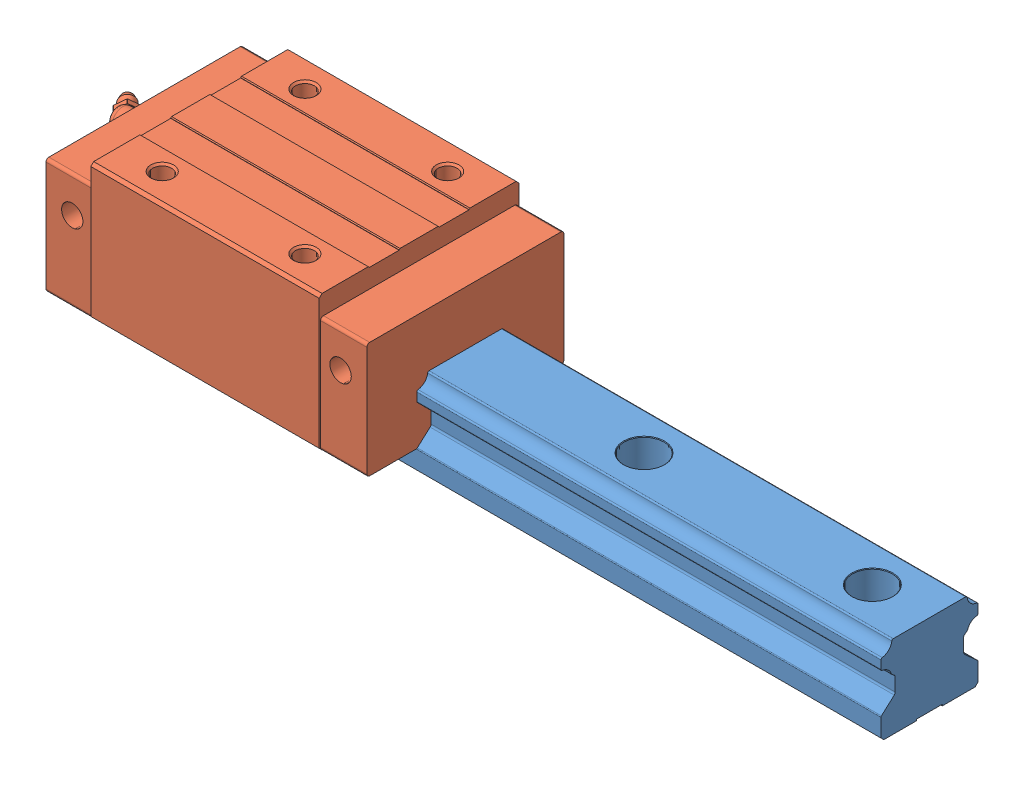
SolidWorks assembly HLH35CA.stp.sldasm, configuration 默认 (file format 13000). Lengths in mm.
Overall size (289.43 55 70).
2 component instances, 2 part files, 0 mates.
Components (placement in the parent):
- HLR35R280 E=20-1: HLR35R280 E=20.SLDPRT [默认] at origin size (280 29 34)
- HLH35CA-1: HLH35CA.SLDPRT [默认] at (5 7.5 0) size (126.83 47.5 70)
